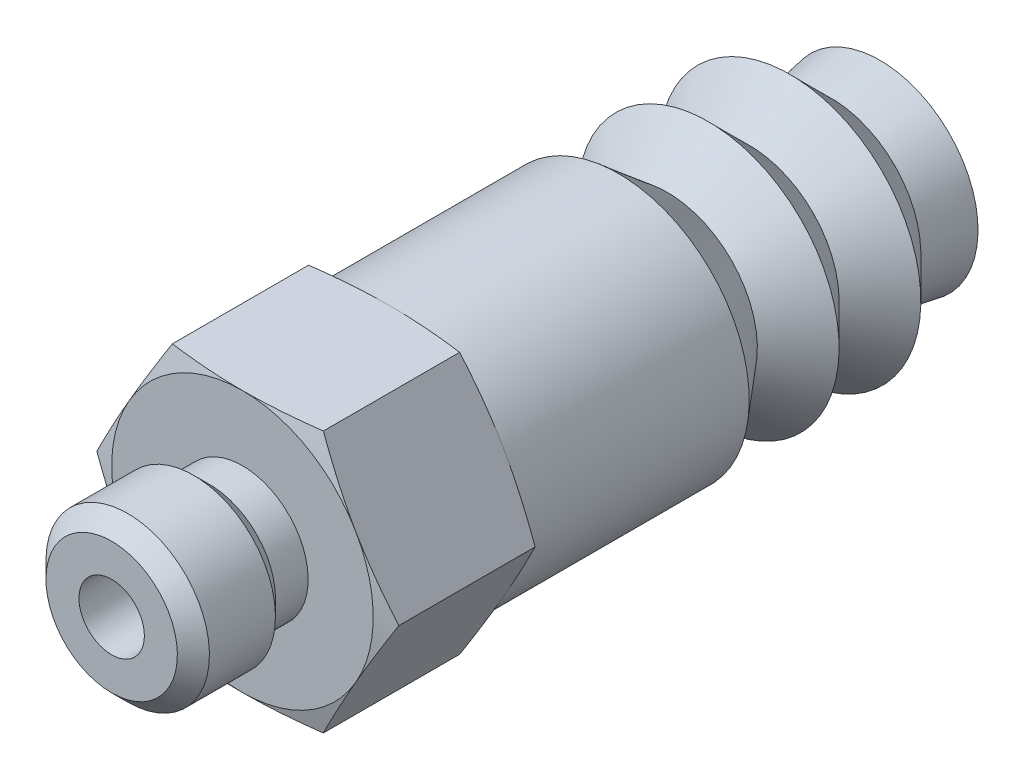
ISO-10303-21;
HEADER;
FILE_DESCRIPTION(('STEP AP214'),'2;1');
FILE_NAME('part.step','',(''),(''),'','','');
FILE_SCHEMA(('AUTOMOTIVE_DESIGN { 1 0 10303 214 1 1 1 1 }'));
ENDSEC;
DATA;
#1=APPLICATION_CONTEXT('core data for automotive mechanical design processes');
#2=APPLICATION_PROTOCOL_DEFINITION('international standard','automotive_design',2000,#1);
#3=PRODUCT_CONTEXT('',#1,'mechanical');
#4=PRODUCT('Part','Part','',(#3));
#5=PRODUCT_RELATED_PRODUCT_CATEGORY('part','',(#4));
#6=PRODUCT_DEFINITION_FORMATION('','',#4);
#7=PRODUCT_DEFINITION_CONTEXT('part definition',#1,'design');
#8=PRODUCT_DEFINITION('design','',#6,#7);
#9=PRODUCT_DEFINITION_SHAPE('','',#8);
#10=(LENGTH_UNIT() NAMED_UNIT(*) SI_UNIT(.MILLI.,.METRE.));
#11=(NAMED_UNIT(*) PLANE_ANGLE_UNIT() SI_UNIT($,.RADIAN.));
#12=(NAMED_UNIT(*) SI_UNIT($,.STERADIAN.) SOLID_ANGLE_UNIT());
#13=UNCERTAINTY_MEASURE_WITH_UNIT(LENGTH_MEASURE(1.E-05),#10,'distance_accuracy_value','');
#14=(GEOMETRIC_REPRESENTATION_CONTEXT(3) GLOBAL_UNCERTAINTY_ASSIGNED_CONTEXT((#13)) GLOBAL_UNIT_ASSIGNED_CONTEXT((#10,
#11,#12)) REPRESENTATION_CONTEXT('',''));
#15=CARTESIAN_POINT('',(0.,0.,0.));
#16=DIRECTION('',(0.,0.,1.));
#17=DIRECTION('',(1.,0.,0.));
#18=AXIS2_PLACEMENT_3D('',#15,#16,#17);
#19=CARTESIAN_POINT('',(4.61880215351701,0.,19.5));
#20=DIRECTION('',(-0.866025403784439,-0.5,0.));
#21=DIRECTION('',(0.,0.,-1.));
#22=AXIS2_PLACEMENT_3D('',#19,#20,#21);
#23=PLANE('',#22);
#24=CARTESIAN_POINT('',(4.61880215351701,0.,15.1658075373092));
#25=CARTESIAN_POINT('',(4.00000000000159,1.07179676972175,15.));
#26=CARTESIAN_POINT('',(3.46410161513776,2.,15.));
#27=B_SPLINE_CURVE_WITH_KNOTS('',2,(#24,#25,#26),.UNSPECIFIED.,.F.,.F.,(3,3),(0.,1.),.UNSPECIFIED.);
#28=CARTESIAN_POINT('',(4.61880215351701,0.,15.1658075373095));
#29=VERTEX_POINT('',#28);
#30=CARTESIAN_POINT('',(3.46410161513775,2.,15.));
#31=VERTEX_POINT('',#30);
#32=EDGE_CURVE('E330',#29,#31,#27,.T.);
#33=ORIENTED_EDGE('',*,*,#32,.T.);
#34=CARTESIAN_POINT('',(3.46410161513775,2.00000000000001,15.));
#35=CARTESIAN_POINT('',(2.92820323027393,2.92820323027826,15.));
#36=CARTESIAN_POINT('',(2.30940107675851,4.,15.1658075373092));
#37=B_SPLINE_CURVE_WITH_KNOTS('',2,(#34,#35,#36),.UNSPECIFIED.,.F.,.F.,(3,3),(0.,1.),.UNSPECIFIED.);
#38=CARTESIAN_POINT('',(2.3094010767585,4.,15.1658075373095));
#39=VERTEX_POINT('',#38);
#40=EDGE_CURVE('E1320',#31,#39,#37,.T.);
#41=ORIENTED_EDGE('',*,*,#40,.T.);
#42=DIRECTION('',(0.,0.,-1.));
#43=VECTOR('',#42,1.);
#44=CARTESIAN_POINT('',(2.3094010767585,4.,19.5));
#45=LINE('',#44,#43);
#46=CARTESIAN_POINT('',(2.3094010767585,4.,19.3341924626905));
#47=VERTEX_POINT('',#46);
#48=EDGE_CURVE('E10',#47,#39,#45,.T.);
#49=ORIENTED_EDGE('',*,*,#48,.F.);
#50=CARTESIAN_POINT('',(2.30940107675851,4.,19.3341924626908));
#51=CARTESIAN_POINT('',(2.92820323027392,2.92820323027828,19.5));
#52=CARTESIAN_POINT('',(3.46410161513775,2.00000000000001,19.5));
#53=B_SPLINE_CURVE_WITH_KNOTS('',2,(#50,#51,#52),.UNSPECIFIED.,.F.,.F.,(3,3),(0.,1.),.UNSPECIFIED.);
#54=CARTESIAN_POINT('',(3.46410161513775,2.,19.5));
#55=VERTEX_POINT('',#54);
#56=EDGE_CURVE('E241',#47,#55,#53,.T.);
#57=ORIENTED_EDGE('',*,*,#56,.T.);
#58=CARTESIAN_POINT('',(3.46410161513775,2.00000000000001,19.5));
#59=CARTESIAN_POINT('',(4.0000000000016,1.07179676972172,19.5));
#60=CARTESIAN_POINT('',(4.61880215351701,0.,19.3341924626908));
#61=B_SPLINE_CURVE_WITH_KNOTS('',2,(#58,#59,#60),.UNSPECIFIED.,.F.,.F.,(3,3),(0.,1.),.UNSPECIFIED.);
#62=CARTESIAN_POINT('',(4.61880215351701,0.,19.3341924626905));
#63=VERTEX_POINT('',#62);
#64=EDGE_CURVE('E291',#55,#63,#61,.T.);
#65=ORIENTED_EDGE('',*,*,#64,.T.);
#66=DIRECTION('',(0.,0.,-1.));
#67=VECTOR('',#66,1.);
#68=CARTESIAN_POINT('',(4.61880215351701,0.,19.5));
#69=LINE('',#68,#67);
#70=EDGE_CURVE('E296',#63,#29,#69,.T.);
#71=ORIENTED_EDGE('',*,*,#70,.T.);
#72=EDGE_LOOP('',(#33,#41,#49,#57,#65,#71));
#73=FACE_BOUND('',#72,.T.);
#74=ADVANCED_FACE('F15',(#73),#23,.F.);
#75=CARTESIAN_POINT('',(2.3094010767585,4.,19.5));
#76=DIRECTION('',(0.,-1.,0.));
#77=DIRECTION('',(0.,0.,-1.));
#78=AXIS2_PLACEMENT_3D('',#75,#76,#77);
#79=PLANE('',#78);
#80=CARTESIAN_POINT('',(2.3094010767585,4.,15.1658075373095));
#81=CARTESIAN_POINT('',(1.07179676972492,4.,15.));
#82=CARTESIAN_POINT('',(0.,4.,15.));
#83=B_SPLINE_CURVE_WITH_KNOTS('',2,(#80,#81,#82),.UNSPECIFIED.,.F.,.F.,(3,3),(0.,1.),.UNSPECIFIED.);
#84=CARTESIAN_POINT('',(0.,4.,15.));
#85=VERTEX_POINT('',#84);
#86=EDGE_CURVE('E1235',#39,#85,#83,.T.);
#87=ORIENTED_EDGE('',*,*,#86,.T.);
#88=CARTESIAN_POINT('',(0.,4.,15.));
#89=CARTESIAN_POINT('',(-1.0717967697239,4.,15.));
#90=CARTESIAN_POINT('',(-2.3094010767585,4.,15.1658075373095));
#91=B_SPLINE_CURVE_WITH_KNOTS('',2,(#88,#89,#90),.UNSPECIFIED.,.F.,.F.,(3,3),(0.,1.),.UNSPECIFIED.);
#92=CARTESIAN_POINT('',(-2.3094010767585,4.,15.1658075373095));
#93=VERTEX_POINT('',#92);
#94=EDGE_CURVE('E386',#85,#93,#91,.T.);
#95=ORIENTED_EDGE('',*,*,#94,.T.);
#96=DIRECTION('',(0.,0.,-1.));
#97=VECTOR('',#96,1.);
#98=CARTESIAN_POINT('',(-2.3094010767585,4.,19.5));
#99=LINE('',#98,#97);
#100=CARTESIAN_POINT('',(-2.3094010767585,4.,19.3341924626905));
#101=VERTEX_POINT('',#100);
#102=EDGE_CURVE('E28',#101,#93,#99,.T.);
#103=ORIENTED_EDGE('',*,*,#102,.F.);
#104=CARTESIAN_POINT('',(-2.3094010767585,4.,19.3341924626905));
#105=CARTESIAN_POINT('',(-1.07179676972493,4.,19.5));
#106=CARTESIAN_POINT('',(0.,4.,19.5));
#107=B_SPLINE_CURVE_WITH_KNOTS('',2,(#104,#105,#106),.UNSPECIFIED.,.F.,.F.,(3,3),(0.,1.),.UNSPECIFIED.);
#108=CARTESIAN_POINT('',(0.,4.,19.5));
#109=VERTEX_POINT('',#108);
#110=EDGE_CURVE('E435',#101,#109,#107,.T.);
#111=ORIENTED_EDGE('',*,*,#110,.T.);
#112=CARTESIAN_POINT('',(0.,4.,19.5));
#113=CARTESIAN_POINT('',(1.07179676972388,4.,19.5));
#114=CARTESIAN_POINT('',(2.3094010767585,4.,19.3341924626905));
#115=B_SPLINE_CURVE_WITH_KNOTS('',2,(#112,#113,#114),.UNSPECIFIED.,.F.,.F.,(3,3),(0.,1.),.UNSPECIFIED.);
#116=EDGE_CURVE('E1365',#109,#47,#115,.T.);
#117=ORIENTED_EDGE('',*,*,#116,.T.);
#118=ORIENTED_EDGE('',*,*,#48,.T.);
#119=EDGE_LOOP('',(#87,#95,#103,#111,#117,#118));
#120=FACE_BOUND('',#119,.T.);
#121=ADVANCED_FACE('F261',(#120),#79,.F.);
#122=CARTESIAN_POINT('',(-2.3094010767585,4.,19.5));
#123=DIRECTION('',(0.866025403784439,-0.5,0.));
#124=DIRECTION('',(0.5,0.866025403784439,0.));
#125=AXIS2_PLACEMENT_3D('',#122,#123,#124);
#126=PLANE('',#125);
#127=CARTESIAN_POINT('',(-2.3094010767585,4.,15.1658075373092));
#128=CARTESIAN_POINT('',(-2.92820323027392,2.92820323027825,15.));
#129=CARTESIAN_POINT('',(-3.46410161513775,1.99999999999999,15.));
#130=B_SPLINE_CURVE_WITH_KNOTS('',2,(#127,#128,#129),.UNSPECIFIED.,.F.,.F.,(3,3),(0.,1.),.UNSPECIFIED.);
#131=CARTESIAN_POINT('',(-3.46410161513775,2.,15.));
#132=VERTEX_POINT('',#131);
#133=EDGE_CURVE('E673',#93,#132,#130,.T.);
#134=ORIENTED_EDGE('',*,*,#133,.T.);
#135=CARTESIAN_POINT('',(-3.46410161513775,1.99999999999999,15.));
#136=CARTESIAN_POINT('',(-4.00000000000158,1.07179676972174,15.));
#137=CARTESIAN_POINT('',(-4.618802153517,0.,15.1658075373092));
#138=B_SPLINE_CURVE_WITH_KNOTS('',2,(#135,#136,#137),.UNSPECIFIED.,.F.,.F.,(3,3),(0.,1.),.UNSPECIFIED.);
#139=CARTESIAN_POINT('',(-4.61880215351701,0.,15.1658075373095));
#140=VERTEX_POINT('',#139);
#141=EDGE_CURVE('E645',#132,#140,#138,.T.);
#142=ORIENTED_EDGE('',*,*,#141,.T.);
#143=DIRECTION('',(0.,0.,-1.));
#144=VECTOR('',#143,1.);
#145=CARTESIAN_POINT('',(-4.61880215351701,0.,19.5));
#146=LINE('',#145,#144);
#147=CARTESIAN_POINT('',(-4.61880215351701,0.,19.3341924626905));
#148=VERTEX_POINT('',#147);
#149=EDGE_CURVE('E1253',#148,#140,#146,.T.);
#150=ORIENTED_EDGE('',*,*,#149,.F.);
#151=CARTESIAN_POINT('',(-4.618802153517,0.,19.3341924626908));
#152=CARTESIAN_POINT('',(-4.0000000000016,1.07179676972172,19.5));
#153=CARTESIAN_POINT('',(-3.46410161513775,2.,19.5));
#154=B_SPLINE_CURVE_WITH_KNOTS('',2,(#151,#152,#153),.UNSPECIFIED.,.F.,.F.,(3,3),(0.,1.),.UNSPECIFIED.);
#155=CARTESIAN_POINT('',(-3.46410161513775,2.,19.5));
#156=VERTEX_POINT('',#155);
#157=EDGE_CURVE('E1435',#148,#156,#154,.T.);
#158=ORIENTED_EDGE('',*,*,#157,.T.);
#159=CARTESIAN_POINT('',(-3.46410161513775,1.99999999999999,19.5));
#160=CARTESIAN_POINT('',(-2.92820323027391,2.92820323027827,19.5));
#161=CARTESIAN_POINT('',(-2.3094010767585,4.,19.3341924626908));
#162=B_SPLINE_CURVE_WITH_KNOTS('',2,(#159,#160,#161),.UNSPECIFIED.,.F.,.F.,(3,3),(0.,1.),.UNSPECIFIED.);
#163=EDGE_CURVE('E473',#156,#101,#162,.T.);
#164=ORIENTED_EDGE('',*,*,#163,.T.);
#165=ORIENTED_EDGE('',*,*,#102,.T.);
#166=EDGE_LOOP('',(#134,#142,#150,#158,#164,#165));
#167=FACE_BOUND('',#166,.T.);
#168=ADVANCED_FACE('F402',(#167),#126,.F.);
#169=CARTESIAN_POINT('',(-4.61880215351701,0.,19.5));
#170=DIRECTION('',(0.866025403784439,0.5,0.));
#171=DIRECTION('',(0.,0.,1.));
#172=AXIS2_PLACEMENT_3D('',#169,#170,#171);
#173=PLANE('',#172);
#174=CARTESIAN_POINT('',(-4.61880215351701,0.,15.1658075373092));
#175=CARTESIAN_POINT('',(-4.00000000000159,-1.07179676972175,15.));
#176=CARTESIAN_POINT('',(-3.46410161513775,-2.00000000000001,15.));
#177=B_SPLINE_CURVE_WITH_KNOTS('',2,(#174,#175,#176),.UNSPECIFIED.,.F.,.F.,(3,3),(0.,1.),.UNSPECIFIED.);
#178=CARTESIAN_POINT('',(-3.46410161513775,-2.,15.));
#179=VERTEX_POINT('',#178);
#180=EDGE_CURVE('E521',#140,#179,#177,.T.);
#181=ORIENTED_EDGE('',*,*,#180,.T.);
#182=CARTESIAN_POINT('',(-3.46410161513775,-2.00000000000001,15.));
#183=CARTESIAN_POINT('',(-2.92820323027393,-2.92820323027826,15.));
#184=CARTESIAN_POINT('',(-2.30940107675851,-4.,15.1658075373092));
#185=B_SPLINE_CURVE_WITH_KNOTS('',2,(#182,#183,#184),.UNSPECIFIED.,.F.,.F.,(3,3),(0.,1.),.UNSPECIFIED.);
#186=CARTESIAN_POINT('',(-2.3094010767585,-4.,15.1658075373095));
#187=VERTEX_POINT('',#186);
#188=EDGE_CURVE('E697',#179,#187,#185,.T.);
#189=ORIENTED_EDGE('',*,*,#188,.T.);
#190=DIRECTION('',(0.,0.,-1.));
#191=VECTOR('',#190,1.);
#192=CARTESIAN_POINT('',(-2.3094010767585,-4.,19.5));
#193=LINE('',#192,#191);
#194=CARTESIAN_POINT('',(-2.3094010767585,-4.,19.3341924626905));
#195=VERTEX_POINT('',#194);
#196=EDGE_CURVE('E705',#195,#187,#193,.T.);
#197=ORIENTED_EDGE('',*,*,#196,.F.);
#198=CARTESIAN_POINT('',(-2.30940107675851,-4.,19.3341924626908));
#199=CARTESIAN_POINT('',(-2.92820323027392,-2.92820323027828,19.5));
#200=CARTESIAN_POINT('',(-3.46410161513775,-2.00000000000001,19.5));
#201=B_SPLINE_CURVE_WITH_KNOTS('',2,(#198,#199,#200),.UNSPECIFIED.,.F.,.F.,(3,3),(0.,1.),.UNSPECIFIED.);
#202=CARTESIAN_POINT('',(-3.46410161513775,-2.,19.5));
#203=VERTEX_POINT('',#202);
#204=EDGE_CURVE('E1432',#195,#203,#201,.T.);
#205=ORIENTED_EDGE('',*,*,#204,.T.);
#206=CARTESIAN_POINT('',(-3.46410161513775,-2.00000000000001,19.5));
#207=CARTESIAN_POINT('',(-4.0000000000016,-1.07179676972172,19.5));
#208=CARTESIAN_POINT('',(-4.61880215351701,0.,19.3341924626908));
#209=B_SPLINE_CURVE_WITH_KNOTS('',2,(#206,#207,#208),.UNSPECIFIED.,.F.,.F.,(3,3),(0.,1.),.UNSPECIFIED.);
#210=EDGE_CURVE('E474',#203,#148,#209,.T.);
#211=ORIENTED_EDGE('',*,*,#210,.T.);
#212=ORIENTED_EDGE('',*,*,#149,.T.);
#213=EDGE_LOOP('',(#181,#189,#197,#205,#211,#212));
#214=FACE_BOUND('',#213,.T.);
#215=ADVANCED_FACE('F487',(#214),#173,.F.);
#216=CARTESIAN_POINT('',(-2.3094010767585,-4.,19.5));
#217=DIRECTION('',(0.,1.,0.));
#218=DIRECTION('',(-1.,0.,0.));
#219=AXIS2_PLACEMENT_3D('',#216,#217,#218);
#220=PLANE('',#219);
#221=CARTESIAN_POINT('',(-2.3094010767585,-4.,15.1658075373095));
#222=CARTESIAN_POINT('',(-1.07179676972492,-4.,15.));
#223=CARTESIAN_POINT('',(0.,-4.,15.));
#224=B_SPLINE_CURVE_WITH_KNOTS('',2,(#221,#222,#223),.UNSPECIFIED.,.F.,.F.,(3,3),(0.,1.),.UNSPECIFIED.);
#225=CARTESIAN_POINT('',(0.,-4.,15.));
#226=VERTEX_POINT('',#225);
#227=EDGE_CURVE('E552',#187,#226,#224,.T.);
#228=ORIENTED_EDGE('',*,*,#227,.T.);
#229=CARTESIAN_POINT('',(0.,-4.,15.));
#230=CARTESIAN_POINT('',(1.0717967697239,-4.,15.));
#231=CARTESIAN_POINT('',(2.3094010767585,-4.,15.1658075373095));
#232=B_SPLINE_CURVE_WITH_KNOTS('',2,(#229,#230,#231),.UNSPECIFIED.,.F.,.F.,(3,3),(0.,1.),.UNSPECIFIED.);
#233=CARTESIAN_POINT('',(2.3094010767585,-4.,15.1658075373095));
#234=VERTEX_POINT('',#233);
#235=EDGE_CURVE('E379',#226,#234,#232,.T.);
#236=ORIENTED_EDGE('',*,*,#235,.T.);
#237=DIRECTION('',(0.,0.,-1.));
#238=VECTOR('',#237,1.);
#239=CARTESIAN_POINT('',(2.3094010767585,-4.,19.5));
#240=LINE('',#239,#238);
#241=CARTESIAN_POINT('',(2.3094010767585,-4.,19.3341924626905));
#242=VERTEX_POINT('',#241);
#243=EDGE_CURVE('E1246',#242,#234,#240,.T.);
#244=ORIENTED_EDGE('',*,*,#243,.F.);
#245=CARTESIAN_POINT('',(2.3094010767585,-4.,19.3341924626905));
#246=CARTESIAN_POINT('',(1.07179676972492,-4.,19.5));
#247=CARTESIAN_POINT('',(0.,-4.,19.5));
#248=B_SPLINE_CURVE_WITH_KNOTS('',2,(#245,#246,#247),.UNSPECIFIED.,.F.,.F.,(3,3),(0.,1.),.UNSPECIFIED.);
#249=CARTESIAN_POINT('',(0.,-4.,19.5));
#250=VERTEX_POINT('',#249);
#251=EDGE_CURVE('E1284',#242,#250,#248,.T.);
#252=ORIENTED_EDGE('',*,*,#251,.T.);
#253=CARTESIAN_POINT('',(0.,-4.,19.5));
#254=CARTESIAN_POINT('',(-1.07179676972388,-4.,19.5));
#255=CARTESIAN_POINT('',(-2.3094010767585,-4.,19.3341924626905));
#256=B_SPLINE_CURVE_WITH_KNOTS('',2,(#253,#254,#255),.UNSPECIFIED.,.F.,.F.,(3,3),(0.,1.),.UNSPECIFIED.);
#257=EDGE_CURVE('E1467',#250,#195,#256,.T.);
#258=ORIENTED_EDGE('',*,*,#257,.T.);
#259=ORIENTED_EDGE('',*,*,#196,.T.);
#260=EDGE_LOOP('',(#228,#236,#244,#252,#258,#259));
#261=FACE_BOUND('',#260,.T.);
#262=ADVANCED_FACE('F495',(#261),#220,.F.);
#263=CARTESIAN_POINT('',(2.3094010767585,-4.,19.5));
#264=DIRECTION('',(-0.866025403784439,0.5,0.));
#265=DIRECTION('',(0.,0.,-1.));
#266=AXIS2_PLACEMENT_3D('',#263,#264,#265);
#267=PLANE('',#266);
#268=CARTESIAN_POINT('',(2.3094010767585,-4.,15.1658075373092));
#269=CARTESIAN_POINT('',(2.92820323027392,-2.92820323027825,15.));
#270=CARTESIAN_POINT('',(3.46410161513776,-2.,15.));
#271=B_SPLINE_CURVE_WITH_KNOTS('',2,(#268,#269,#270),.UNSPECIFIED.,.F.,.F.,(3,3),(0.,1.),.UNSPECIFIED.);
#272=CARTESIAN_POINT('',(3.46410161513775,-2.,15.));
#273=VERTEX_POINT('',#272);
#274=EDGE_CURVE('E378',#234,#273,#271,.T.);
#275=ORIENTED_EDGE('',*,*,#274,.T.);
#276=CARTESIAN_POINT('',(3.46410161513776,-2.,15.));
#277=CARTESIAN_POINT('',(4.00000000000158,-1.07179676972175,15.));
#278=CARTESIAN_POINT('',(4.61880215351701,0.,15.1658075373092));
#279=B_SPLINE_CURVE_WITH_KNOTS('',2,(#276,#277,#278),.UNSPECIFIED.,.F.,.F.,(3,3),(0.,1.),.UNSPECIFIED.);
#280=EDGE_CURVE('E1308',#273,#29,#279,.T.);
#281=ORIENTED_EDGE('',*,*,#280,.T.);
#282=ORIENTED_EDGE('',*,*,#70,.F.);
#283=CARTESIAN_POINT('',(4.61880215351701,0.,19.3341924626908));
#284=CARTESIAN_POINT('',(4.0000000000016,-1.07179676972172,19.5));
#285=CARTESIAN_POINT('',(3.46410161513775,-2.,19.5));
#286=B_SPLINE_CURVE_WITH_KNOTS('',2,(#283,#284,#285),.UNSPECIFIED.,.F.,.F.,(3,3),(0.,1.),.UNSPECIFIED.);
#287=CARTESIAN_POINT('',(3.46410161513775,-2.,19.5));
#288=VERTEX_POINT('',#287);
#289=EDGE_CURVE('E1288',#63,#288,#286,.T.);
#290=ORIENTED_EDGE('',*,*,#289,.T.);
#291=CARTESIAN_POINT('',(3.46410161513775,-2.,19.5));
#292=CARTESIAN_POINT('',(2.92820323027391,-2.92820323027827,19.5));
#293=CARTESIAN_POINT('',(2.3094010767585,-4.,19.3341924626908));
#294=B_SPLINE_CURVE_WITH_KNOTS('',2,(#291,#292,#293),.UNSPECIFIED.,.F.,.F.,(3,3),(0.,1.),.UNSPECIFIED.);
#295=EDGE_CURVE('E1264',#288,#242,#294,.T.);
#296=ORIENTED_EDGE('',*,*,#295,.T.);
#297=ORIENTED_EDGE('',*,*,#243,.T.);
#298=EDGE_LOOP('',(#275,#281,#282,#290,#296,#297));
#299=FACE_BOUND('',#298,.T.);
#300=ADVANCED_FACE('F567',(#299),#267,.F.);
#301=CARTESIAN_POINT('',(-2.0095,0.,23.5));
#302=DIRECTION('',(0.,0.,1.));
#303=DIRECTION('',(-1.,0.,0.));
#304=AXIS2_PLACEMENT_3D('',#301,#302,#303);
#305=PLANE('',#304);
#306=CARTESIAN_POINT('',(0.,0.,23.5));
#307=DIRECTION('',(0.,0.,-1.));
#308=DIRECTION('',(0.,-1.,0.));
#309=AXIS2_PLACEMENT_3D('',#306,#307,#308);
#310=CIRCLE('',#309,2.0095);
#311=CARTESIAN_POINT('',(0.,-2.0095,23.5));
#312=VERTEX_POINT('',#311);
#313=EDGE_CURVE('E40',#312,#312,#310,.T.);
#314=ORIENTED_EDGE('',*,*,#313,.F.);
#315=EDGE_LOOP('',(#314));
#316=FACE_BOUND('',#315,.T.);
#317=CARTESIAN_POINT('',(0.,0.,23.5));
#318=DIRECTION('',(0.,0.,-1.));
#319=DIRECTION('',(0.,-1.,0.));
#320=AXIS2_PLACEMENT_3D('',#317,#318,#319);
#321=CIRCLE('',#320,1.);
#322=CARTESIAN_POINT('',(0.,-1.,23.5));
#323=VERTEX_POINT('',#322);
#324=EDGE_CURVE('E1216',#323,#323,#321,.T.);
#325=ORIENTED_EDGE('',*,*,#324,.T.);
#326=EDGE_LOOP('',(#325));
#327=FACE_BOUND('',#326,.T.);
#328=ADVANCED_FACE('F922',(#316,#327),#305,.T.);
#329=CARTESIAN_POINT('',(0.,0.,23.0095));
#330=DIRECTION('',(0.,0.,-1.));
#331=DIRECTION('',(0.,-1.,0.));
#332=AXIS2_PLACEMENT_3D('',#329,#330,#331);
#333=CONICAL_SURFACE('',#332,2.5,0.785398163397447);
#334=CARTESIAN_POINT('',(0.,0.,23.0095));
#335=DIRECTION('',(0.,0.,-1.));
#336=DIRECTION('',(0.,-1.,0.));
#337=AXIS2_PLACEMENT_3D('',#334,#335,#336);
#338=CIRCLE('',#337,2.5);
#339=CARTESIAN_POINT('',(0.,-2.5,23.0095));
#340=VERTEX_POINT('',#339);
#341=EDGE_CURVE('E1240',#340,#340,#338,.T.);
#342=ORIENTED_EDGE('',*,*,#341,.F.);
#343=EDGE_LOOP('',(#342));
#344=FACE_BOUND('',#343,.T.);
#345=ORIENTED_EDGE('',*,*,#313,.T.);
#346=EDGE_LOOP('',(#345));
#347=FACE_BOUND('',#346,.T.);
#348=ADVANCED_FACE('F915',(#344,#347),#333,.T.);
#349=CARTESIAN_POINT('',(0.,0.,15.));
#350=DIRECTION('',(0.,0.,-1.));
#351=DIRECTION('',(0.,-1.,0.));
#352=AXIS2_PLACEMENT_3D('',#349,#350,#351);
#353=CYLINDRICAL_SURFACE('',#352,2.5);
#354=CARTESIAN_POINT('',(0.,0.,20.9905));
#355=DIRECTION('',(0.,0.,-1.));
#356=DIRECTION('',(0.,-1.,0.));
#357=AXIS2_PLACEMENT_3D('',#354,#355,#356);
#358=CIRCLE('',#357,2.5);
#359=CARTESIAN_POINT('',(0.,-2.5,20.9905));
#360=VERTEX_POINT('',#359);
#361=EDGE_CURVE('E235',#360,#360,#358,.T.);
#362=ORIENTED_EDGE('',*,*,#361,.F.);
#363=EDGE_LOOP('',(#362));
#364=FACE_BOUND('',#363,.T.);
#365=ORIENTED_EDGE('',*,*,#341,.T.);
#366=EDGE_LOOP('',(#365));
#367=FACE_BOUND('',#366,.T.);
#368=ADVANCED_FACE('F359',(#364,#367),#353,.T.);
#369=CARTESIAN_POINT('',(0.,0.,20.5));
#370=DIRECTION('',(0.,0.,1.));
#371=DIRECTION('',(0.,1.,0.));
#372=AXIS2_PLACEMENT_3D('',#369,#370,#371);
#373=CONICAL_SURFACE('',#372,2.0095,0.785398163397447);
#374=CARTESIAN_POINT('',(0.,0.,20.5));
#375=DIRECTION('',(0.,0.,-1.));
#376=DIRECTION('',(0.,-1.,0.));
#377=AXIS2_PLACEMENT_3D('',#374,#375,#376);
#378=CIRCLE('',#377,2.0095);
#379=CARTESIAN_POINT('',(0.,-2.0095,20.5));
#380=VERTEX_POINT('',#379);
#381=EDGE_CURVE('E240',#380,#380,#378,.T.);
#382=ORIENTED_EDGE('',*,*,#381,.F.);
#383=EDGE_LOOP('',(#382));
#384=FACE_BOUND('',#383,.T.);
#385=ORIENTED_EDGE('',*,*,#361,.T.);
#386=EDGE_LOOP('',(#385));
#387=FACE_BOUND('',#386,.T.);
#388=ADVANCED_FACE('F262',(#384,#387),#373,.T.);
#389=CARTESIAN_POINT('',(0.,0.,15.));
#390=DIRECTION('',(0.,0.,-1.));
#391=DIRECTION('',(0.,-1.,0.));
#392=AXIS2_PLACEMENT_3D('',#389,#390,#391);
#393=CYLINDRICAL_SURFACE('',#392,2.0095);
#394=CARTESIAN_POINT('',(0.,0.,19.5));
#395=DIRECTION('',(0.,0.,-1.));
#396=DIRECTION('',(0.,-1.,0.));
#397=AXIS2_PLACEMENT_3D('',#394,#395,#396);
#398=CIRCLE('',#397,2.0095);
#399=CARTESIAN_POINT('',(0.,-2.0095,19.5));
#400=VERTEX_POINT('',#399);
#401=EDGE_CURVE('E237',#400,#400,#398,.T.);
#402=ORIENTED_EDGE('',*,*,#401,.F.);
#403=EDGE_LOOP('',(#402));
#404=FACE_BOUND('',#403,.T.);
#405=ORIENTED_EDGE('',*,*,#381,.T.);
#406=EDGE_LOOP('',(#405));
#407=FACE_BOUND('',#406,.T.);
#408=ADVANCED_FACE('F894',(#404,#407),#393,.T.);
#409=CARTESIAN_POINT('',(-4.,0.,19.5));
#410=DIRECTION('',(0.,0.,1.));
#411=DIRECTION('',(-1.,0.,0.));
#412=AXIS2_PLACEMENT_3D('',#409,#410,#411);
#413=PLANE('',#412);
#414=CARTESIAN_POINT('',(0.,0.,19.5));
#415=DIRECTION('',(0.,0.,-1.));
#416=DIRECTION('',(0.,-1.,0.));
#417=AXIS2_PLACEMENT_3D('',#414,#415,#416);
#418=CIRCLE('',#417,4.);
#419=EDGE_CURVE('E464',#203,#156,#418,.T.);
#420=ORIENTED_EDGE('',*,*,#419,.F.);
#421=CARTESIAN_POINT('',(0.,0.,19.5));
#422=DIRECTION('',(0.,0.,-1.));
#423=DIRECTION('',(0.,-1.,0.));
#424=AXIS2_PLACEMENT_3D('',#421,#422,#423);
#425=CIRCLE('',#424,4.);
#426=EDGE_CURVE('E1436',#250,#203,#425,.T.);
#427=ORIENTED_EDGE('',*,*,#426,.F.);
#428=CARTESIAN_POINT('',(0.,0.,19.5));
#429=DIRECTION('',(0.,0.,-1.));
#430=DIRECTION('',(0.,-1.,0.));
#431=AXIS2_PLACEMENT_3D('',#428,#429,#430);
#432=CIRCLE('',#431,4.);
#433=EDGE_CURVE('E1282',#288,#250,#432,.T.);
#434=ORIENTED_EDGE('',*,*,#433,.F.);
#435=CARTESIAN_POINT('',(0.,0.,19.5));
#436=DIRECTION('',(0.,0.,-1.));
#437=DIRECTION('',(0.,-1.,0.));
#438=AXIS2_PLACEMENT_3D('',#435,#436,#437);
#439=CIRCLE('',#438,4.);
#440=EDGE_CURVE('E1286',#55,#288,#439,.T.);
#441=ORIENTED_EDGE('',*,*,#440,.F.);
#442=CARTESIAN_POINT('',(0.,0.,19.5));
#443=DIRECTION('',(0.,0.,-1.));
#444=DIRECTION('',(0.,-1.,0.));
#445=AXIS2_PLACEMENT_3D('',#442,#443,#444);
#446=CIRCLE('',#445,4.);
#447=EDGE_CURVE('E1414',#109,#55,#446,.T.);
#448=ORIENTED_EDGE('',*,*,#447,.F.);
#449=CARTESIAN_POINT('',(0.,0.,19.5));
#450=DIRECTION('',(0.,0.,-1.));
#451=DIRECTION('',(0.,-1.,0.));
#452=AXIS2_PLACEMENT_3D('',#449,#450,#451);
#453=CIRCLE('',#452,4.);
#454=EDGE_CURVE('E1400',#156,#109,#453,.T.);
#455=ORIENTED_EDGE('',*,*,#454,.F.);
#456=EDGE_LOOP('',(#420,#427,#434,#441,#448,#455));
#457=FACE_BOUND('',#456,.T.);
#458=ORIENTED_EDGE('',*,*,#401,.T.);
#459=EDGE_LOOP('',(#458));
#460=FACE_BOUND('',#459,.T.);
#461=ADVANCED_FACE('F887',(#457,#460),#413,.T.);
#462=CARTESIAN_POINT('',(0.,0.,19.2856406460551));
#463=DIRECTION('',(0.,0.,-1.));
#464=DIRECTION('',(0.,-1.,0.));
#465=AXIS2_PLACEMENT_3D('',#462,#463,#464);
#466=CONICAL_SURFACE('',#465,4.8,1.30899693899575);
#467=ORIENTED_EDGE('',*,*,#116,.F.);
#468=ORIENTED_EDGE('',*,*,#447,.T.);
#469=ORIENTED_EDGE('',*,*,#56,.F.);
#470=EDGE_LOOP('',(#467,#468,#469));
#471=FACE_BOUND('',#470,.T.);
#472=ADVANCED_FACE('F361',(#471),#466,.T.);
#473=CARTESIAN_POINT('',(0.,0.,15.));
#474=DIRECTION('',(0.,0.,1.));
#475=DIRECTION('',(0.,1.,0.));
#476=AXIS2_PLACEMENT_3D('',#473,#474,#475);
#477=CONICAL_SURFACE('',#476,4.,1.30899693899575);
#478=ORIENTED_EDGE('',*,*,#86,.F.);
#479=ORIENTED_EDGE('',*,*,#40,.F.);
#480=CARTESIAN_POINT('',(0.,0.,15.));
#481=DIRECTION('',(0.,0.,-1.));
#482=DIRECTION('',(0.,-1.,0.));
#483=AXIS2_PLACEMENT_3D('',#480,#481,#482);
#484=CIRCLE('',#483,4.);
#485=EDGE_CURVE('E1217',#85,#31,#484,.T.);
#486=ORIENTED_EDGE('',*,*,#485,.F.);
#487=EDGE_LOOP('',(#478,#479,#486));
#488=FACE_BOUND('',#487,.T.);
#489=ADVANCED_FACE('F874',(#488),#477,.T.);
#490=CARTESIAN_POINT('',(-1.,0.,15.));
#491=DIRECTION('',(0.,0.,-1.));
#492=DIRECTION('',(0.,-1.,0.));
#493=AXIS2_PLACEMENT_3D('',#490,#491,#492);
#494=PLANE('',#493);
#495=CARTESIAN_POINT('',(0.,0.,15.));
#496=DIRECTION('',(0.,0.,-1.));
#497=DIRECTION('',(0.,-1.,0.));
#498=AXIS2_PLACEMENT_3D('',#495,#496,#497);
#499=CIRCLE('',#498,1.);
#500=CARTESIAN_POINT('',(0.,-1.,15.));
#501=VERTEX_POINT('',#500);
#502=EDGE_CURVE('E1215',#501,#501,#499,.T.);
#503=ORIENTED_EDGE('',*,*,#502,.F.);
#504=EDGE_LOOP('',(#503));
#505=FACE_BOUND('',#504,.T.);
#506=CARTESIAN_POINT('',(0.,0.,15.));
#507=DIRECTION('',(0.,0.,-1.));
#508=DIRECTION('',(0.,-1.,0.));
#509=AXIS2_PLACEMENT_3D('',#506,#507,#508);
#510=CIRCLE('',#509,2.);
#511=CARTESIAN_POINT('',(0.,-2.,15.));
#512=VERTEX_POINT('',#511);
#513=EDGE_CURVE('E1195',#512,#512,#510,.T.);
#514=ORIENTED_EDGE('',*,*,#513,.T.);
#515=EDGE_LOOP('',(#514));
#516=FACE_BOUND('',#515,.T.);
#517=ADVANCED_FACE('F867',(#505,#516),#494,.T.);
#518=CARTESIAN_POINT('',(0.,0.,15.));
#519=DIRECTION('',(0.,0.,-1.));
#520=DIRECTION('',(0.,-1.,0.));
#521=AXIS2_PLACEMENT_3D('',#518,#519,#520);
#522=CYLINDRICAL_SURFACE('',#521,1.);
#523=ORIENTED_EDGE('',*,*,#324,.F.);
#524=EDGE_LOOP('',(#523));
#525=FACE_BOUND('',#524,.T.);
#526=ORIENTED_EDGE('',*,*,#502,.T.);
#527=EDGE_LOOP('',(#526));
#528=FACE_BOUND('',#527,.T.);
#529=ADVANCED_FACE('F860',(#525,#528),#522,.F.);
#530=CARTESIAN_POINT('',(0.,0.,0.));
#531=DIRECTION('',(0.,0.,-1.));
#532=DIRECTION('',(0.,-1.,0.));
#533=AXIS2_PLACEMENT_3D('',#530,#531,#532);
#534=CYLINDRICAL_SURFACE('',#533,4.);
#535=CARTESIAN_POINT('',(0.,0.,8.));
#536=DIRECTION('',(0.,0.,-1.));
#537=DIRECTION('',(0.,-1.,0.));
#538=AXIS2_PLACEMENT_3D('',#535,#536,#537);
#539=CIRCLE('',#538,4.);
#540=CARTESIAN_POINT('',(0.,-4.,8.));
#541=VERTEX_POINT('',#540);
#542=EDGE_CURVE('E1218',#541,#541,#539,.T.);
#543=ORIENTED_EDGE('',*,*,#542,.F.);
#544=EDGE_LOOP('',(#543));
#545=FACE_BOUND('',#544,.T.);
#546=CARTESIAN_POINT('',(0.,0.,15.));
#547=DIRECTION('',(0.,0.,-1.));
#548=DIRECTION('',(0.,-1.,0.));
#549=AXIS2_PLACEMENT_3D('',#546,#547,#548);
#550=CIRCLE('',#549,4.);
#551=EDGE_CURVE('E604',#226,#179,#550,.T.);
#552=ORIENTED_EDGE('',*,*,#551,.T.);
#553=CARTESIAN_POINT('',(0.,0.,15.));
#554=DIRECTION('',(0.,0.,-1.));
#555=DIRECTION('',(0.,-1.,0.));
#556=AXIS2_PLACEMENT_3D('',#553,#554,#555);
#557=CIRCLE('',#556,4.);
#558=EDGE_CURVE('E641',#179,#132,#557,.T.);
#559=ORIENTED_EDGE('',*,*,#558,.T.);
#560=CARTESIAN_POINT('',(0.,0.,15.));
#561=DIRECTION('',(0.,0.,-1.));
#562=DIRECTION('',(0.,-1.,0.));
#563=AXIS2_PLACEMENT_3D('',#560,#561,#562);
#564=CIRCLE('',#563,4.);
#565=EDGE_CURVE('E686',#132,#85,#564,.T.);
#566=ORIENTED_EDGE('',*,*,#565,.T.);
#567=ORIENTED_EDGE('',*,*,#485,.T.);
#568=CARTESIAN_POINT('',(0.,0.,15.));
#569=DIRECTION('',(0.,0.,-1.));
#570=DIRECTION('',(0.,-1.,0.));
#571=AXIS2_PLACEMENT_3D('',#568,#569,#570);
#572=CIRCLE('',#571,4.);
#573=EDGE_CURVE('E1305',#31,#273,#572,.T.);
#574=ORIENTED_EDGE('',*,*,#573,.T.);
#575=CARTESIAN_POINT('',(0.,0.,15.));
#576=DIRECTION('',(0.,0.,-1.));
#577=DIRECTION('',(0.,-1.,0.));
#578=AXIS2_PLACEMENT_3D('',#575,#576,#577);
#579=CIRCLE('',#578,4.);
#580=EDGE_CURVE('E370',#273,#226,#579,.T.);
#581=ORIENTED_EDGE('',*,*,#580,.T.);
#582=EDGE_LOOP('',(#552,#559,#566,#567,#574,#581));
#583=FACE_BOUND('',#582,.T.);
#584=ADVANCED_FACE('F404',(#545,#583),#534,.T.);
#585=CARTESIAN_POINT('',(0.,0.,6.5));
#586=DIRECTION('',(0.,0.,1.));
#587=DIRECTION('',(0.,1.,0.));
#588=AXIS2_PLACEMENT_3D('',#585,#586,#587);
#589=CONICAL_SURFACE('',#588,2.75,0.694738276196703);
#590=CARTESIAN_POINT('',(0.,0.,6.5));
#591=DIRECTION('',(0.,0.,-1.));
#592=DIRECTION('',(0.,-1.,0.));
#593=AXIS2_PLACEMENT_3D('',#590,#591,#592);
#594=CIRCLE('',#593,2.75);
#595=CARTESIAN_POINT('',(0.,-2.75,6.5));
#596=VERTEX_POINT('',#595);
#597=EDGE_CURVE('E109',#596,#596,#594,.T.);
#598=ORIENTED_EDGE('',*,*,#597,.F.);
#599=EDGE_LOOP('',(#598));
#600=FACE_BOUND('',#599,.T.);
#601=ORIENTED_EDGE('',*,*,#542,.T.);
#602=EDGE_LOOP('',(#601));
#603=FACE_BOUND('',#602,.T.);
#604=ADVANCED_FACE('F847',(#600,#603),#589,.T.);
#605=CARTESIAN_POINT('',(0.,0.,5.25));
#606=DIRECTION('',(0.,0.,-1.));
#607=DIRECTION('',(0.,-1.,0.));
#608=AXIS2_PLACEMENT_3D('',#605,#606,#607);
#609=CONICAL_SURFACE('',#608,4.,0.785398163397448);
#610=CARTESIAN_POINT('',(0.,0.,5.25));
#611=DIRECTION('',(0.,0.,-1.));
#612=DIRECTION('',(0.,-1.,0.));
#613=AXIS2_PLACEMENT_3D('',#610,#611,#612);
#614=CIRCLE('',#613,4.);
#615=CARTESIAN_POINT('',(0.,-4.,5.25));
#616=VERTEX_POINT('',#615);
#617=EDGE_CURVE('E121',#616,#616,#614,.T.);
#618=ORIENTED_EDGE('',*,*,#617,.F.);
#619=EDGE_LOOP('',(#618));
#620=FACE_BOUND('',#619,.T.);
#621=ORIENTED_EDGE('',*,*,#597,.T.);
#622=EDGE_LOOP('',(#621));
#623=FACE_BOUND('',#622,.T.);
#624=ADVANCED_FACE('F614',(#620,#623),#609,.T.);
#625=CARTESIAN_POINT('',(0.,0.,4.));
#626=DIRECTION('',(0.,0.,1.));
#627=DIRECTION('',(0.,1.,0.));
#628=AXIS2_PLACEMENT_3D('',#625,#626,#627);
#629=CONICAL_SURFACE('',#628,2.75,0.785398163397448);
#630=CARTESIAN_POINT('',(0.,0.,4.));
#631=DIRECTION('',(0.,0.,-1.));
#632=DIRECTION('',(0.,-1.,0.));
#633=AXIS2_PLACEMENT_3D('',#630,#631,#632);
#634=CIRCLE('',#633,2.75);
#635=CARTESIAN_POINT('',(0.,-2.75,4.));
#636=VERTEX_POINT('',#635);
#637=EDGE_CURVE('E1213',#636,#636,#634,.T.);
#638=ORIENTED_EDGE('',*,*,#637,.F.);
#639=EDGE_LOOP('',(#638));
#640=FACE_BOUND('',#639,.T.);
#641=ORIENTED_EDGE('',*,*,#617,.T.);
#642=EDGE_LOOP('',(#641));
#643=FACE_BOUND('',#642,.T.);
#644=ADVANCED_FACE('F834',(#640,#643),#629,.T.);
#645=CARTESIAN_POINT('',(0.,0.,2.75));
#646=DIRECTION('',(0.,0.,-1.));
#647=DIRECTION('',(0.,-1.,0.));
#648=AXIS2_PLACEMENT_3D('',#645,#646,#647);
#649=CONICAL_SURFACE('',#648,4.,0.785398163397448);
#650=CARTESIAN_POINT('',(0.,0.,2.75));
#651=DIRECTION('',(0.,0.,-1.));
#652=DIRECTION('',(0.,-1.,0.));
#653=AXIS2_PLACEMENT_3D('',#650,#651,#652);
#654=CIRCLE('',#653,4.);
#655=CARTESIAN_POINT('',(0.,-4.,2.75));
#656=VERTEX_POINT('',#655);
#657=EDGE_CURVE('E1211',#656,#656,#654,.T.);
#658=ORIENTED_EDGE('',*,*,#657,.F.);
#659=EDGE_LOOP('',(#658));
#660=FACE_BOUND('',#659,.T.);
#661=ORIENTED_EDGE('',*,*,#637,.T.);
#662=EDGE_LOOP('',(#661));
#663=FACE_BOUND('',#662,.T.);
#664=ADVANCED_FACE('F827',(#660,#663),#649,.T.);
#665=CARTESIAN_POINT('',(0.,0.,1.5));
#666=DIRECTION('',(0.,0.,1.));
#667=DIRECTION('',(0.,1.,0.));
#668=AXIS2_PLACEMENT_3D('',#665,#666,#667);
#669=CONICAL_SURFACE('',#668,2.75,0.785398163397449);
#670=CARTESIAN_POINT('',(0.,0.,1.5));
#671=DIRECTION('',(0.,0.,-1.));
#672=DIRECTION('',(0.,-1.,0.));
#673=AXIS2_PLACEMENT_3D('',#670,#671,#672);
#674=CIRCLE('',#673,2.75);
#675=CARTESIAN_POINT('',(0.,-2.75,1.5));
#676=VERTEX_POINT('',#675);
#677=EDGE_CURVE('E228',#676,#676,#674,.T.);
#678=ORIENTED_EDGE('',*,*,#677,.F.);
#679=EDGE_LOOP('',(#678));
#680=FACE_BOUND('',#679,.T.);
#681=ORIENTED_EDGE('',*,*,#657,.T.);
#682=EDGE_LOOP('',(#681));
#683=FACE_BOUND('',#682,.T.);
#684=ADVANCED_FACE('F820',(#680,#683),#669,.T.);
#685=CARTESIAN_POINT('',(0.,0.,0.));
#686=DIRECTION('',(0.,0.,-1.));
#687=DIRECTION('',(0.,-1.,0.));
#688=AXIS2_PLACEMENT_3D('',#685,#686,#687);
#689=CONICAL_SURFACE('',#688,3.,0.165148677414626);
#690=CARTESIAN_POINT('',(0.,0.,0.));
#691=DIRECTION('',(0.,0.,-1.));
#692=DIRECTION('',(0.,-1.,0.));
#693=AXIS2_PLACEMENT_3D('',#690,#691,#692);
#694=CIRCLE('',#693,3.);
#695=CARTESIAN_POINT('',(0.,-3.,0.));
#696=VERTEX_POINT('',#695);
#697=EDGE_CURVE('E220',#696,#696,#694,.T.);
#698=ORIENTED_EDGE('',*,*,#697,.F.);
#699=EDGE_LOOP('',(#698));
#700=FACE_BOUND('',#699,.T.);
#701=ORIENTED_EDGE('',*,*,#677,.T.);
#702=EDGE_LOOP('',(#701));
#703=FACE_BOUND('',#702,.T.);
#704=ADVANCED_FACE('F455',(#700,#703),#689,.T.);
#705=CARTESIAN_POINT('',(-2.7,0.,0.));
#706=DIRECTION('',(0.,0.,-1.));
#707=DIRECTION('',(0.,-1.,0.));
#708=AXIS2_PLACEMENT_3D('',#705,#706,#707);
#709=PLANE('',#708);
#710=CARTESIAN_POINT('',(0.,0.,0.));
#711=DIRECTION('',(0.,0.,-1.));
#712=DIRECTION('',(0.,-1.,0.));
#713=AXIS2_PLACEMENT_3D('',#710,#711,#712);
#714=CIRCLE('',#713,2.7);
#715=CARTESIAN_POINT('',(0.,-2.7,0.));
#716=VERTEX_POINT('',#715);
#717=EDGE_CURVE('E216',#716,#716,#714,.T.);
#718=ORIENTED_EDGE('',*,*,#717,.F.);
#719=EDGE_LOOP('',(#718));
#720=FACE_BOUND('',#719,.T.);
#721=ORIENTED_EDGE('',*,*,#697,.T.);
#722=EDGE_LOOP('',(#721));
#723=FACE_BOUND('',#722,.T.);
#724=ADVANCED_FACE('F17',(#720,#723),#709,.T.);
#725=CARTESIAN_POINT('',(0.,0.,1.5));
#726=DIRECTION('',(0.,0.,-1.));
#727=DIRECTION('',(0.,-1.,0.));
#728=AXIS2_PLACEMENT_3D('',#725,#726,#727);
#729=CONICAL_SURFACE('',#728,2.5,0.132551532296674);
#730=CARTESIAN_POINT('',(0.,0.,1.5));
#731=DIRECTION('',(0.,0.,-1.));
#732=DIRECTION('',(0.,-1.,0.));
#733=AXIS2_PLACEMENT_3D('',#730,#731,#732);
#734=CIRCLE('',#733,2.5);
#735=CARTESIAN_POINT('',(0.,-2.5,1.5));
#736=VERTEX_POINT('',#735);
#737=EDGE_CURVE('E221',#736,#736,#734,.T.);
#738=ORIENTED_EDGE('',*,*,#737,.F.);
#739=EDGE_LOOP('',(#738));
#740=FACE_BOUND('',#739,.T.);
#741=ORIENTED_EDGE('',*,*,#717,.T.);
#742=EDGE_LOOP('',(#741));
#743=FACE_BOUND('',#742,.T.);
#744=ADVANCED_FACE('F217',(#740,#743),#729,.F.);
#745=CARTESIAN_POINT('',(0.,0.,2.75));
#746=DIRECTION('',(0.,0.,1.));
#747=DIRECTION('',(0.,1.,0.));
#748=AXIS2_PLACEMENT_3D('',#745,#746,#747);
#749=CONICAL_SURFACE('',#748,3.25,0.540419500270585);
#750=CARTESIAN_POINT('',(0.,0.,2.75));
#751=DIRECTION('',(0.,0.,-1.));
#752=DIRECTION('',(0.,-1.,0.));
#753=AXIS2_PLACEMENT_3D('',#750,#751,#752);
#754=CIRCLE('',#753,3.25);
#755=CARTESIAN_POINT('',(0.,-3.25,2.75));
#756=VERTEX_POINT('',#755);
#757=EDGE_CURVE('E231',#756,#756,#754,.T.);
#758=ORIENTED_EDGE('',*,*,#757,.F.);
#759=EDGE_LOOP('',(#758));
#760=FACE_BOUND('',#759,.T.);
#761=ORIENTED_EDGE('',*,*,#737,.T.);
#762=EDGE_LOOP('',(#761));
#763=FACE_BOUND('',#762,.T.);
#764=ADVANCED_FACE('F794',(#760,#763),#749,.F.);
#765=CARTESIAN_POINT('',(0.,0.,4.));
#766=DIRECTION('',(0.,0.,-1.));
#767=DIRECTION('',(0.,-1.,0.));
#768=AXIS2_PLACEMENT_3D('',#765,#766,#767);
#769=CONICAL_SURFACE('',#768,2.,0.785398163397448);
#770=CARTESIAN_POINT('',(0.,0.,4.));
#771=DIRECTION('',(0.,0.,-1.));
#772=DIRECTION('',(0.,-1.,0.));
#773=AXIS2_PLACEMENT_3D('',#770,#771,#772);
#774=CIRCLE('',#773,2.);
#775=CARTESIAN_POINT('',(0.,-2.,4.));
#776=VERTEX_POINT('',#775);
#777=EDGE_CURVE('E1194',#776,#776,#774,.T.);
#778=ORIENTED_EDGE('',*,*,#777,.F.);
#779=EDGE_LOOP('',(#778));
#780=FACE_BOUND('',#779,.T.);
#781=ORIENTED_EDGE('',*,*,#757,.T.);
#782=EDGE_LOOP('',(#781));
#783=FACE_BOUND('',#782,.T.);
#784=ADVANCED_FACE('F403',(#780,#783),#769,.F.);
#785=CARTESIAN_POINT('',(0.,0.,5.25));
#786=DIRECTION('',(0.,0.,1.));
#787=DIRECTION('',(0.,1.,0.));
#788=AXIS2_PLACEMENT_3D('',#785,#786,#787);
#789=CONICAL_SURFACE('',#788,3.25,0.785398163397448);
#790=CARTESIAN_POINT('',(0.,0.,5.25));
#791=DIRECTION('',(0.,0.,-1.));
#792=DIRECTION('',(0.,-1.,0.));
#793=AXIS2_PLACEMENT_3D('',#790,#791,#792);
#794=CIRCLE('',#793,3.25);
#795=CARTESIAN_POINT('',(0.,-3.25,5.25));
#796=VERTEX_POINT('',#795);
#797=EDGE_CURVE('E1192',#796,#796,#794,.T.);
#798=ORIENTED_EDGE('',*,*,#797,.F.);
#799=EDGE_LOOP('',(#798));
#800=FACE_BOUND('',#799,.T.);
#801=ORIENTED_EDGE('',*,*,#777,.T.);
#802=EDGE_LOOP('',(#801));
#803=FACE_BOUND('',#802,.T.);
#804=ADVANCED_FACE('F310',(#800,#803),#789,.F.);
#805=CARTESIAN_POINT('',(0.,0.,6.5));
#806=DIRECTION('',(0.,0.,-1.));
#807=DIRECTION('',(0.,-1.,0.));
#808=AXIS2_PLACEMENT_3D('',#805,#806,#807);
#809=CONICAL_SURFACE('',#808,2.,0.785398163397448);
#810=CARTESIAN_POINT('',(0.,0.,6.5));
#811=DIRECTION('',(0.,0.,-1.));
#812=DIRECTION('',(0.,-1.,0.));
#813=AXIS2_PLACEMENT_3D('',#810,#811,#812);
#814=CIRCLE('',#813,2.);
#815=CARTESIAN_POINT('',(0.,-2.,6.5));
#816=VERTEX_POINT('',#815);
#817=EDGE_CURVE('E1202',#816,#816,#814,.T.);
#818=ORIENTED_EDGE('',*,*,#817,.F.);
#819=EDGE_LOOP('',(#818));
#820=FACE_BOUND('',#819,.T.);
#821=ORIENTED_EDGE('',*,*,#797,.T.);
#822=EDGE_LOOP('',(#821));
#823=FACE_BOUND('',#822,.T.);
#824=ADVANCED_FACE('F616',(#820,#823),#809,.F.);
#825=CARTESIAN_POINT('',(0.,0.,0.));
#826=DIRECTION('',(0.,0.,-1.));
#827=DIRECTION('',(0.,-1.,0.));
#828=AXIS2_PLACEMENT_3D('',#825,#826,#827);
#829=CYLINDRICAL_SURFACE('',#828,2.);
#830=ORIENTED_EDGE('',*,*,#513,.F.);
#831=EDGE_LOOP('',(#830));
#832=FACE_BOUND('',#831,.T.);
#833=ORIENTED_EDGE('',*,*,#817,.T.);
#834=EDGE_LOOP('',(#833));
#835=FACE_BOUND('',#834,.T.);
#836=ADVANCED_FACE('F264',(#832,#835),#829,.F.);
#837=CARTESIAN_POINT('',(0.,0.,19.2856406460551));
#838=DIRECTION('',(0.,0.,-1.));
#839=DIRECTION('',(0.,-1.,0.));
#840=AXIS2_PLACEMENT_3D('',#837,#838,#839);
#841=CONICAL_SURFACE('',#840,4.8,1.30899693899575);
#842=ORIENTED_EDGE('',*,*,#163,.F.);
#843=ORIENTED_EDGE('',*,*,#454,.T.);
#844=ORIENTED_EDGE('',*,*,#110,.F.);
#845=EDGE_LOOP('',(#842,#843,#844));
#846=FACE_BOUND('',#845,.T.);
#847=ADVANCED_FACE('F442',(#846),#841,.T.);
#848=CARTESIAN_POINT('',(0.,0.,19.2856406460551));
#849=DIRECTION('',(0.,0.,-1.));
#850=DIRECTION('',(0.,-1.,0.));
#851=AXIS2_PLACEMENT_3D('',#848,#849,#850);
#852=CONICAL_SURFACE('',#851,4.8,1.30899693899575);
#853=ORIENTED_EDGE('',*,*,#157,.F.);
#854=ORIENTED_EDGE('',*,*,#210,.F.);
#855=ORIENTED_EDGE('',*,*,#419,.T.);
#856=EDGE_LOOP('',(#853,#854,#855));
#857=FACE_BOUND('',#856,.T.);
#858=ADVANCED_FACE('F451',(#857),#852,.T.);
#859=CARTESIAN_POINT('',(0.,0.,19.2856406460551));
#860=DIRECTION('',(0.,0.,-1.));
#861=DIRECTION('',(0.,-1.,0.));
#862=AXIS2_PLACEMENT_3D('',#859,#860,#861);
#863=CONICAL_SURFACE('',#862,4.8,1.30899693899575);
#864=ORIENTED_EDGE('',*,*,#257,.F.);
#865=ORIENTED_EDGE('',*,*,#426,.T.);
#866=ORIENTED_EDGE('',*,*,#204,.F.);
#867=EDGE_LOOP('',(#864,#865,#866));
#868=FACE_BOUND('',#867,.T.);
#869=ADVANCED_FACE('F312',(#868),#863,.T.);
#870=CARTESIAN_POINT('',(0.,0.,19.2856406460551));
#871=DIRECTION('',(0.,0.,-1.));
#872=DIRECTION('',(0.,-1.,0.));
#873=AXIS2_PLACEMENT_3D('',#870,#871,#872);
#874=CONICAL_SURFACE('',#873,4.8,1.30899693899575);
#875=ORIENTED_EDGE('',*,*,#295,.F.);
#876=ORIENTED_EDGE('',*,*,#433,.T.);
#877=ORIENTED_EDGE('',*,*,#251,.F.);
#878=EDGE_LOOP('',(#875,#876,#877));
#879=FACE_BOUND('',#878,.T.);
#880=ADVANCED_FACE('F309',(#879),#874,.T.);
#881=CARTESIAN_POINT('',(0.,0.,19.2856406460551));
#882=DIRECTION('',(0.,0.,-1.));
#883=DIRECTION('',(0.,-1.,0.));
#884=AXIS2_PLACEMENT_3D('',#881,#882,#883);
#885=CONICAL_SURFACE('',#884,4.8,1.30899693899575);
#886=ORIENTED_EDGE('',*,*,#289,.F.);
#887=ORIENTED_EDGE('',*,*,#64,.F.);
#888=ORIENTED_EDGE('',*,*,#440,.T.);
#889=EDGE_LOOP('',(#886,#887,#888));
#890=FACE_BOUND('',#889,.T.);
#891=ADVANCED_FACE('F298',(#890),#885,.T.);
#892=CARTESIAN_POINT('',(0.,0.,15.));
#893=DIRECTION('',(0.,0.,1.));
#894=DIRECTION('',(0.,1.,0.));
#895=AXIS2_PLACEMENT_3D('',#892,#893,#894);
#896=CONICAL_SURFACE('',#895,4.,1.30899693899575);
#897=ORIENTED_EDGE('',*,*,#280,.F.);
#898=ORIENTED_EDGE('',*,*,#573,.F.);
#899=ORIENTED_EDGE('',*,*,#32,.F.);
#900=EDGE_LOOP('',(#897,#898,#899));
#901=FACE_BOUND('',#900,.T.);
#902=ADVANCED_FACE('F308',(#901),#896,.T.);
#903=CARTESIAN_POINT('',(0.,0.,15.));
#904=DIRECTION('',(0.,0.,1.));
#905=DIRECTION('',(0.,1.,0.));
#906=AXIS2_PLACEMENT_3D('',#903,#904,#905);
#907=CONICAL_SURFACE('',#906,4.,1.30899693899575);
#908=ORIENTED_EDGE('',*,*,#133,.F.);
#909=ORIENTED_EDGE('',*,*,#94,.F.);
#910=ORIENTED_EDGE('',*,*,#565,.F.);
#911=EDGE_LOOP('',(#908,#909,#910));
#912=FACE_BOUND('',#911,.T.);
#913=ADVANCED_FACE('F358',(#912),#907,.T.);
#914=CARTESIAN_POINT('',(0.,0.,15.));
#915=DIRECTION('',(0.,0.,1.));
#916=DIRECTION('',(0.,1.,0.));
#917=AXIS2_PLACEMENT_3D('',#914,#915,#916);
#918=CONICAL_SURFACE('',#917,4.,1.30899693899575);
#919=ORIENTED_EDGE('',*,*,#235,.F.);
#920=ORIENTED_EDGE('',*,*,#580,.F.);
#921=ORIENTED_EDGE('',*,*,#274,.F.);
#922=EDGE_LOOP('',(#919,#920,#921));
#923=FACE_BOUND('',#922,.T.);
#924=ADVANCED_FACE('F535',(#923),#918,.T.);
#925=CARTESIAN_POINT('',(0.,0.,15.));
#926=DIRECTION('',(0.,0.,1.));
#927=DIRECTION('',(0.,1.,0.));
#928=AXIS2_PLACEMENT_3D('',#925,#926,#927);
#929=CONICAL_SURFACE('',#928,4.,1.30899693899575);
#930=ORIENTED_EDGE('',*,*,#141,.F.);
#931=ORIENTED_EDGE('',*,*,#558,.F.);
#932=ORIENTED_EDGE('',*,*,#180,.F.);
#933=EDGE_LOOP('',(#930,#931,#932));
#934=FACE_BOUND('',#933,.T.);
#935=ADVANCED_FACE('F527',(#934),#929,.T.);
#936=CARTESIAN_POINT('',(0.,0.,15.));
#937=DIRECTION('',(0.,0.,1.));
#938=DIRECTION('',(0.,1.,0.));
#939=AXIS2_PLACEMENT_3D('',#936,#937,#938);
#940=CONICAL_SURFACE('',#939,4.,1.30899693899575);
#941=ORIENTED_EDGE('',*,*,#188,.F.);
#942=ORIENTED_EDGE('',*,*,#551,.F.);
#943=ORIENTED_EDGE('',*,*,#227,.F.);
#944=EDGE_LOOP('',(#941,#942,#943));
#945=FACE_BOUND('',#944,.T.);
#946=ADVANCED_FACE('F452',(#945),#940,.T.);
#947=CLOSED_SHELL('',(#74,#121,#168,#215,#262,#300,#328,#348,#368,#388,#408,#461,#472,#489,#517,
#529,#584,#604,#624,#644,#664,#684,#704,#724,#744,#764,#784,#804,#824,#836,#847,#858,#869,#880,
#891,#902,#913,#924,#935,#946));
#948=MANIFOLD_SOLID_BREP('B1',#947);
#949=ADVANCED_BREP_SHAPE_REPRESENTATION('',(#18,#948),#14);
#950=SHAPE_DEFINITION_REPRESENTATION(#9,#949);
ENDSEC;
END-ISO-10303-21;
